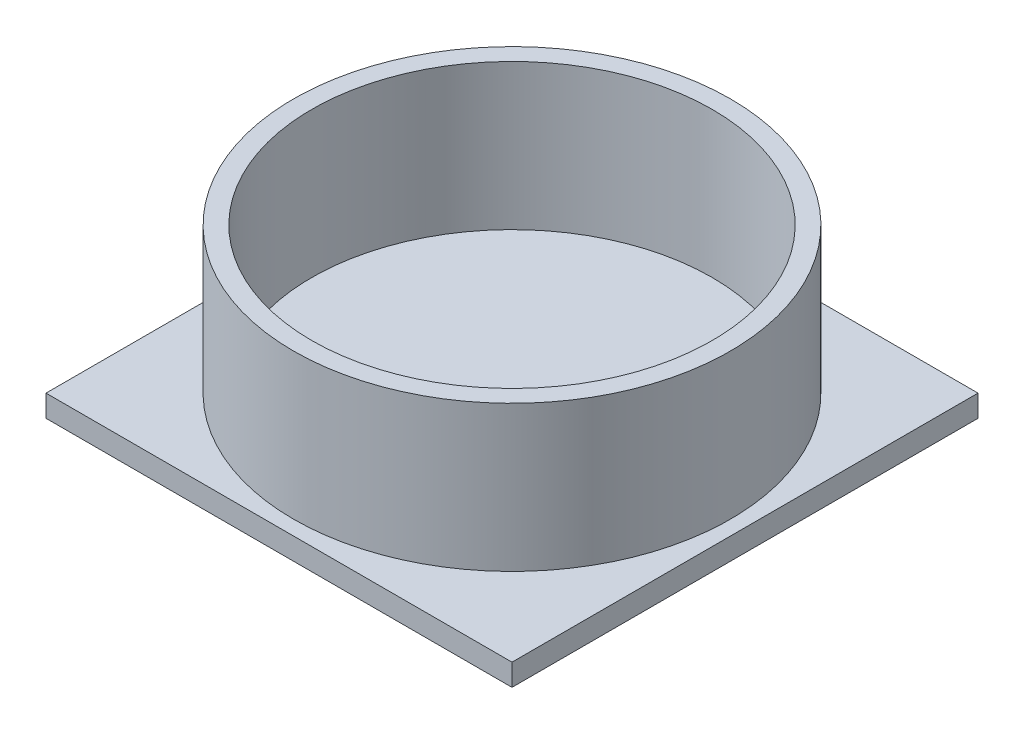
ISO-10303-21;
HEADER;
FILE_DESCRIPTION(('STEP AP214'),'2;1');
FILE_NAME('part.step','',(''),(''),'','','');
FILE_SCHEMA(('AUTOMOTIVE_DESIGN { 1 0 10303 214 1 1 1 1 }'));
ENDSEC;
DATA;
#1=APPLICATION_CONTEXT('core data for automotive mechanical design processes');
#2=APPLICATION_PROTOCOL_DEFINITION('international standard','automotive_design',2000,#1);
#3=PRODUCT_CONTEXT('',#1,'mechanical');
#4=PRODUCT('Part','Part','',(#3));
#5=PRODUCT_RELATED_PRODUCT_CATEGORY('part','',(#4));
#6=PRODUCT_DEFINITION_FORMATION('','',#4);
#7=PRODUCT_DEFINITION_CONTEXT('part definition',#1,'design');
#8=PRODUCT_DEFINITION('design','',#6,#7);
#9=PRODUCT_DEFINITION_SHAPE('','',#8);
#10=(LENGTH_UNIT() NAMED_UNIT(*) SI_UNIT(.MILLI.,.METRE.));
#11=(NAMED_UNIT(*) PLANE_ANGLE_UNIT() SI_UNIT($,.RADIAN.));
#12=(NAMED_UNIT(*) SI_UNIT($,.STERADIAN.) SOLID_ANGLE_UNIT());
#13=UNCERTAINTY_MEASURE_WITH_UNIT(LENGTH_MEASURE(1.E-05),#10,'distance_accuracy_value','');
#14=(GEOMETRIC_REPRESENTATION_CONTEXT(3) GLOBAL_UNCERTAINTY_ASSIGNED_CONTEXT((#13)) GLOBAL_UNIT_ASSIGNED_CONTEXT((#10,
#11,#12)) REPRESENTATION_CONTEXT('',''));
#15=CARTESIAN_POINT('',(0.,0.,0.));
#16=DIRECTION('',(0.,0.,1.));
#17=DIRECTION('',(1.,0.,0.));
#18=AXIS2_PLACEMENT_3D('',#15,#16,#17);
#19=CARTESIAN_POINT('',(0.,200.,0.));
#20=DIRECTION('',(0.,1.,0.));
#21=DIRECTION('',(0.,0.,1.));
#22=AXIS2_PLACEMENT_3D('',#19,#20,#21);
#23=PLANE('',#22);
#24=CARTESIAN_POINT('',(0.,200.,0.));
#25=DIRECTION('',(0.,1.,0.));
#26=DIRECTION('',(0.,0.,1.));
#27=AXIS2_PLACEMENT_3D('',#24,#25,#26);
#28=CIRCLE('',#27,300.);
#29=CARTESIAN_POINT('',(0.,200.,300.));
#30=VERTEX_POINT('',#29);
#31=EDGE_CURVE('E11',#30,#30,#28,.T.);
#32=ORIENTED_EDGE('',*,*,#31,.T.);
#33=EDGE_LOOP('',(#32));
#34=FACE_BOUND('',#33,.T.);
#35=CARTESIAN_POINT('',(0.,200.,0.));
#36=DIRECTION('',(0.,1.,0.));
#37=DIRECTION('',(0.,0.,1.));
#38=AXIS2_PLACEMENT_3D('',#35,#36,#37);
#39=CIRCLE('',#38,275.);
#40=CARTESIAN_POINT('',(0.,200.,275.));
#41=VERTEX_POINT('',#40);
#42=EDGE_CURVE('E49',#41,#41,#39,.T.);
#43=ORIENTED_EDGE('',*,*,#42,.F.);
#44=EDGE_LOOP('',(#43));
#45=FACE_BOUND('',#44,.T.);
#46=ADVANCED_FACE('F39',(#34,#45),#23,.T.);
#47=CARTESIAN_POINT('',(0.,200.,0.));
#48=DIRECTION('',(0.,-1.,0.));
#49=DIRECTION('',(0.,0.,-1.));
#50=AXIS2_PLACEMENT_3D('',#47,#48,#49);
#51=CYLINDRICAL_SURFACE('',#50,300.);
#52=ORIENTED_EDGE('',*,*,#31,.F.);
#53=EDGE_LOOP('',(#52));
#54=FACE_BOUND('',#53,.T.);
#55=CARTESIAN_POINT('',(0.,0.,0.));
#56=DIRECTION('',(0.,1.,0.));
#57=DIRECTION('',(0.,0.,1.));
#58=AXIS2_PLACEMENT_3D('',#55,#56,#57);
#59=CIRCLE('',#58,300.);
#60=CARTESIAN_POINT('',(0.,0.,300.));
#61=VERTEX_POINT('',#60);
#62=EDGE_CURVE('E43',#61,#61,#59,.T.);
#63=ORIENTED_EDGE('',*,*,#62,.T.);
#64=EDGE_LOOP('',(#63));
#65=FACE_BOUND('',#64,.T.);
#66=ADVANCED_FACE('F41',(#54,#65),#51,.T.);
#67=CARTESIAN_POINT('',(0.,200.,0.));
#68=DIRECTION('',(0.,-1.,0.));
#69=DIRECTION('',(0.,0.,-1.));
#70=AXIS2_PLACEMENT_3D('',#67,#68,#69);
#71=CYLINDRICAL_SURFACE('',#70,275.);
#72=ORIENTED_EDGE('',*,*,#42,.T.);
#73=EDGE_LOOP('',(#72));
#74=FACE_BOUND('',#73,.T.);
#75=CARTESIAN_POINT('',(0.,0.,0.));
#76=DIRECTION('',(0.,1.,0.));
#77=DIRECTION('',(0.,0.,1.));
#78=AXIS2_PLACEMENT_3D('',#75,#76,#77);
#79=CIRCLE('',#78,275.);
#80=CARTESIAN_POINT('',(0.,0.,275.));
#81=VERTEX_POINT('',#80);
#82=EDGE_CURVE('E121',#81,#81,#79,.T.);
#83=ORIENTED_EDGE('',*,*,#82,.F.);
#84=EDGE_LOOP('',(#83));
#85=FACE_BOUND('',#84,.T.);
#86=ADVANCED_FACE('F149',(#74,#85),#71,.F.);
#87=CARTESIAN_POINT('',(0.,0.,0.));
#88=DIRECTION('',(0.,-1.,0.));
#89=DIRECTION('',(0.,0.,-1.));
#90=AXIS2_PLACEMENT_3D('',#87,#88,#89);
#91=PLANE('',#90);
#92=ORIENTED_EDGE('',*,*,#82,.T.);
#93=EDGE_LOOP('',(#92));
#94=FACE_BOUND('',#93,.T.);
#95=ADVANCED_FACE('F133',(#94),#91,.F.);
#96=CARTESIAN_POINT('',(-320.,-30.,320.));
#97=DIRECTION('',(-1.,0.,0.));
#98=DIRECTION('',(0.,0.,1.));
#99=AXIS2_PLACEMENT_3D('',#96,#97,#98);
#100=PLANE('',#99);
#101=DIRECTION('',(0.,0.,1.));
#102=VECTOR('',#101,1.);
#103=CARTESIAN_POINT('',(-320.,0.,320.));
#104=LINE('',#103,#102);
#105=CARTESIAN_POINT('',(-320.,0.,-320.));
#106=VERTEX_POINT('',#105);
#107=CARTESIAN_POINT('',(-320.,0.,320.));
#108=VERTEX_POINT('',#107);
#109=EDGE_CURVE('E108',#106,#108,#104,.T.);
#110=ORIENTED_EDGE('',*,*,#109,.F.);
#111=DIRECTION('',(0.,1.,0.));
#112=VECTOR('',#111,1.);
#113=CARTESIAN_POINT('',(-320.,-30.,-320.));
#114=LINE('',#113,#112);
#115=CARTESIAN_POINT('',(-320.,-30.,-320.));
#116=VERTEX_POINT('',#115);
#117=EDGE_CURVE('E57',#116,#106,#114,.T.);
#118=ORIENTED_EDGE('',*,*,#117,.F.);
#119=DIRECTION('',(0.,0.,1.));
#120=VECTOR('',#119,1.);
#121=CARTESIAN_POINT('',(-320.,-30.,320.));
#122=LINE('',#121,#120);
#123=CARTESIAN_POINT('',(-320.,-30.,320.));
#124=VERTEX_POINT('',#123);
#125=EDGE_CURVE('E102',#116,#124,#122,.T.);
#126=ORIENTED_EDGE('',*,*,#125,.T.);
#127=DIRECTION('',(0.,1.,0.));
#128=VECTOR('',#127,1.);
#129=CARTESIAN_POINT('',(-320.,-30.,320.));
#130=LINE('',#129,#128);
#131=EDGE_CURVE('E85',#124,#108,#130,.T.);
#132=ORIENTED_EDGE('',*,*,#131,.T.);
#133=EDGE_LOOP('',(#110,#118,#126,#132));
#134=FACE_BOUND('',#133,.T.);
#135=ADVANCED_FACE('F134',(#134),#100,.T.);
#136=CARTESIAN_POINT('',(-320.,-30.,-320.));
#137=DIRECTION('',(0.,0.,-1.));
#138=DIRECTION('',(-1.,0.,0.));
#139=AXIS2_PLACEMENT_3D('',#136,#137,#138);
#140=PLANE('',#139);
#141=DIRECTION('',(-1.,0.,0.));
#142=VECTOR('',#141,1.);
#143=CARTESIAN_POINT('',(-320.,0.,-320.));
#144=LINE('',#143,#142);
#145=CARTESIAN_POINT('',(320.,0.,-320.));
#146=VERTEX_POINT('',#145);
#147=EDGE_CURVE('E104',#146,#106,#144,.T.);
#148=ORIENTED_EDGE('',*,*,#147,.F.);
#149=DIRECTION('',(0.,1.,0.));
#150=VECTOR('',#149,1.);
#151=CARTESIAN_POINT('',(320.,-30.,-320.));
#152=LINE('',#151,#150);
#153=CARTESIAN_POINT('',(320.,-30.,-320.));
#154=VERTEX_POINT('',#153);
#155=EDGE_CURVE('E74',#154,#146,#152,.T.);
#156=ORIENTED_EDGE('',*,*,#155,.F.);
#157=DIRECTION('',(-1.,0.,0.));
#158=VECTOR('',#157,1.);
#159=CARTESIAN_POINT('',(-320.,-30.,-320.));
#160=LINE('',#159,#158);
#161=EDGE_CURVE('E99',#154,#116,#160,.T.);
#162=ORIENTED_EDGE('',*,*,#161,.T.);
#163=ORIENTED_EDGE('',*,*,#117,.T.);
#164=EDGE_LOOP('',(#148,#156,#162,#163));
#165=FACE_BOUND('',#164,.T.);
#166=ADVANCED_FACE('F135',(#165),#140,.T.);
#167=CARTESIAN_POINT('',(320.,-30.,320.));
#168=DIRECTION('',(1.,0.,0.));
#169=DIRECTION('',(0.,0.,-1.));
#170=AXIS2_PLACEMENT_3D('',#167,#168,#169);
#171=PLANE('',#170);
#172=DIRECTION('',(0.,0.,-1.));
#173=VECTOR('',#172,1.);
#174=CARTESIAN_POINT('',(320.,0.,320.));
#175=LINE('',#174,#173);
#176=CARTESIAN_POINT('',(320.,0.,320.));
#177=VERTEX_POINT('',#176);
#178=EDGE_CURVE('E93',#177,#146,#175,.T.);
#179=ORIENTED_EDGE('',*,*,#178,.F.);
#180=DIRECTION('',(0.,1.,0.));
#181=VECTOR('',#180,1.);
#182=CARTESIAN_POINT('',(320.,-30.,320.));
#183=LINE('',#182,#181);
#184=CARTESIAN_POINT('',(320.,-30.,320.));
#185=VERTEX_POINT('',#184);
#186=EDGE_CURVE('E88',#185,#177,#183,.T.);
#187=ORIENTED_EDGE('',*,*,#186,.F.);
#188=DIRECTION('',(0.,0.,-1.));
#189=VECTOR('',#188,1.);
#190=CARTESIAN_POINT('',(320.,-30.,320.));
#191=LINE('',#190,#189);
#192=EDGE_CURVE('E91',#185,#154,#191,.T.);
#193=ORIENTED_EDGE('',*,*,#192,.T.);
#194=ORIENTED_EDGE('',*,*,#155,.T.);
#195=EDGE_LOOP('',(#179,#187,#193,#194));
#196=FACE_BOUND('',#195,.T.);
#197=ADVANCED_FACE('F90',(#196),#171,.T.);
#198=CARTESIAN_POINT('',(-320.,-30.,320.));
#199=DIRECTION('',(0.,0.,1.));
#200=DIRECTION('',(1.,0.,0.));
#201=AXIS2_PLACEMENT_3D('',#198,#199,#200);
#202=PLANE('',#201);
#203=DIRECTION('',(1.,0.,0.));
#204=VECTOR('',#203,1.);
#205=CARTESIAN_POINT('',(-320.,0.,320.));
#206=LINE('',#205,#204);
#207=EDGE_CURVE('E111',#108,#177,#206,.T.);
#208=ORIENTED_EDGE('',*,*,#207,.F.);
#209=ORIENTED_EDGE('',*,*,#131,.F.);
#210=DIRECTION('',(1.,0.,0.));
#211=VECTOR('',#210,1.);
#212=CARTESIAN_POINT('',(-320.,-30.,320.));
#213=LINE('',#212,#211);
#214=EDGE_CURVE('E98',#124,#185,#213,.T.);
#215=ORIENTED_EDGE('',*,*,#214,.T.);
#216=ORIENTED_EDGE('',*,*,#186,.T.);
#217=EDGE_LOOP('',(#208,#209,#215,#216));
#218=FACE_BOUND('',#217,.T.);
#219=ADVANCED_FACE('F101',(#218),#202,.T.);
#220=CARTESIAN_POINT('',(0.,-30.,0.));
#221=DIRECTION('',(0.,-1.,0.));
#222=DIRECTION('',(0.,0.,-1.));
#223=AXIS2_PLACEMENT_3D('',#220,#221,#222);
#224=PLANE('',#223);
#225=ORIENTED_EDGE('',*,*,#125,.F.);
#226=ORIENTED_EDGE('',*,*,#161,.F.);
#227=ORIENTED_EDGE('',*,*,#192,.F.);
#228=ORIENTED_EDGE('',*,*,#214,.F.);
#229=EDGE_LOOP('',(#225,#226,#227,#228));
#230=FACE_BOUND('',#229,.T.);
#231=ADVANCED_FACE('F97',(#230),#224,.T.);
#232=ORIENTED_EDGE('',*,*,#62,.F.);
#233=EDGE_LOOP('',(#232));
#234=FACE_BOUND('',#233,.T.);
#235=ORIENTED_EDGE('',*,*,#109,.T.);
#236=ORIENTED_EDGE('',*,*,#207,.T.);
#237=ORIENTED_EDGE('',*,*,#178,.T.);
#238=ORIENTED_EDGE('',*,*,#147,.T.);
#239=EDGE_LOOP('',(#235,#236,#237,#238));
#240=FACE_BOUND('',#239,.T.);
#241=ADVANCED_FACE('F129',(#234,#240),#91,.F.);
#242=CLOSED_SHELL('',(#46,#66,#86,#95,#135,#166,#197,#219,#231,#241));
#243=MANIFOLD_SOLID_BREP('B2',#242);
#244=ADVANCED_BREP_SHAPE_REPRESENTATION('',(#18,#243),#14);
#245=SHAPE_DEFINITION_REPRESENTATION(#9,#244);
ENDSEC;
END-ISO-10303-21;
